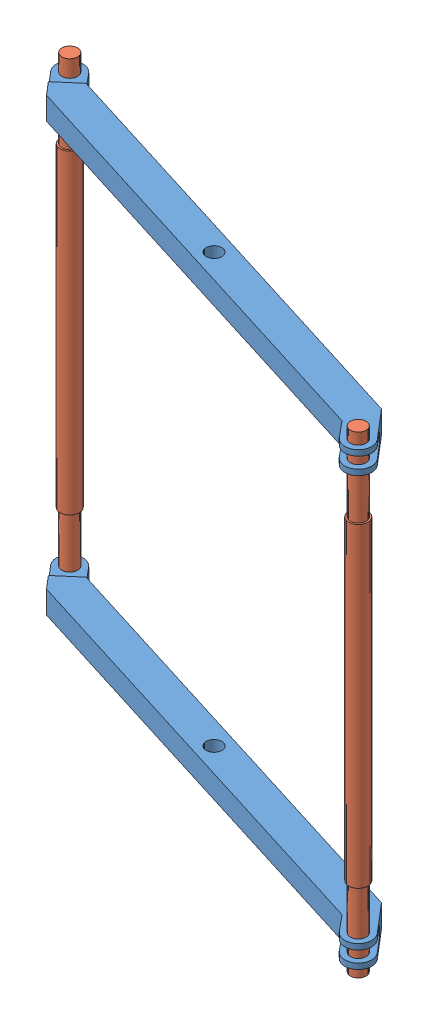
SolidWorks assembly layer_1.SLDASM, configuration Default (file format 11000). Lengths in mm.
Overall size (2311.11 2100 945.79).
4 component instances, 2 part files, 2 mates.
Components (placement in the parent):
- crossarm-1: crossarm.SLDPRT [Default] at (151.3438 950 584.7352) x (0 -1 0) z (-0.954527 0 -0.298125) size (100 260 2340)
- crossarm-2: crossarm.SLDPRT [Default] at (151.3438 -950 584.7352) x (0 -1 0) z (-0.954527 0 -0.298125) size (100 260 2340)
- cross_rod-1: cross_rod.SLDPRT [Default] at (-887.3124 0 187) x (0.999014 0 -0.044391) z (0 -1 0) size (85 85 2100)
- cross_rod-2: cross_rod.SLDPRT [Default] at (1190 0 982.4705) x (1 0 0) z (0 -1 0) size (85 85 2100)
Mates (geometry in assembly coordinates):
- Concentric1: concentric: cylinder of assembly; cylinder of assembly; cylinder of crossarm-1 through (1190 1000 982.4705) axis (0 -1 0) radius 35; cylinder of cross_rod-2 through (1190 -700 982.4705) axis (0 1 0) radius 42.5
- Distance1: distance = 50 mm: plane of assembly; plane of assembly; plane of crossarm-1 through (-782.3144 1000 219.7937) normal (0 1 0); plane of cross_rod-2 through (1190 1050 982.4705) normal (0 1 0)
